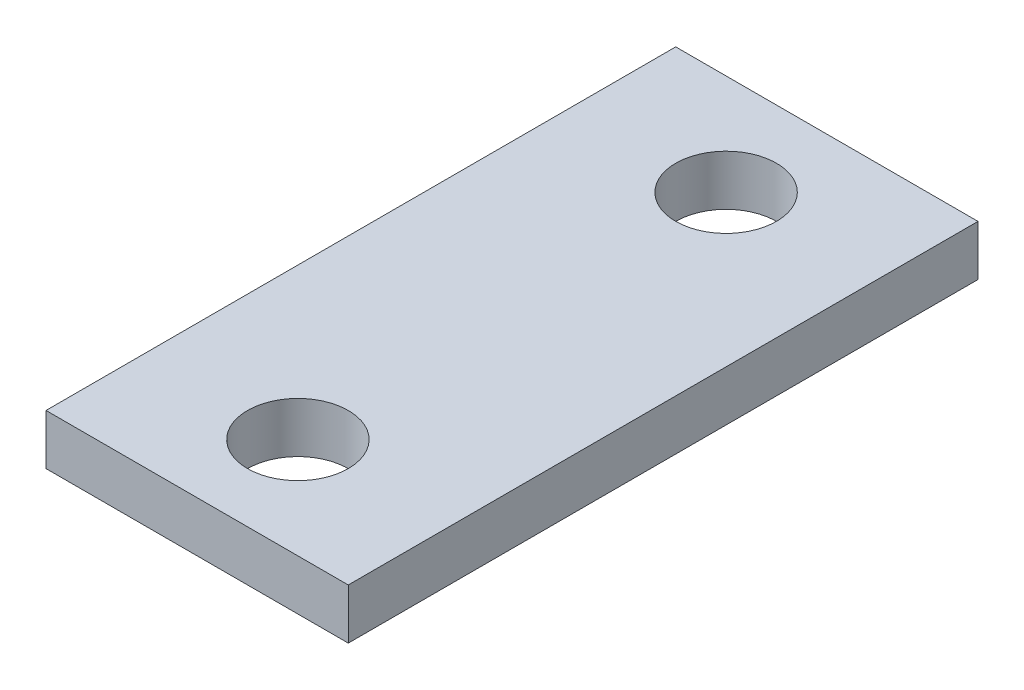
ISO-10303-21;
HEADER;
FILE_DESCRIPTION(('STEP AP214'),'2;1');
FILE_NAME('part.step','',(''),(''),'','','');
FILE_SCHEMA(('AUTOMOTIVE_DESIGN { 1 0 10303 214 1 1 1 1 }'));
ENDSEC;
DATA;
#1=APPLICATION_CONTEXT('core data for automotive mechanical design processes');
#2=APPLICATION_PROTOCOL_DEFINITION('international standard','automotive_design',2000,#1);
#3=PRODUCT_CONTEXT('',#1,'mechanical');
#4=PRODUCT('Part','Part','',(#3));
#5=PRODUCT_RELATED_PRODUCT_CATEGORY('part','',(#4));
#6=PRODUCT_DEFINITION_FORMATION('','',#4);
#7=PRODUCT_DEFINITION_CONTEXT('part definition',#1,'design');
#8=PRODUCT_DEFINITION('design','',#6,#7);
#9=PRODUCT_DEFINITION_SHAPE('','',#8);
#10=(LENGTH_UNIT() NAMED_UNIT(*) SI_UNIT(.MILLI.,.METRE.));
#11=(NAMED_UNIT(*) PLANE_ANGLE_UNIT() SI_UNIT($,.RADIAN.));
#12=(NAMED_UNIT(*) SI_UNIT($,.STERADIAN.) SOLID_ANGLE_UNIT());
#13=UNCERTAINTY_MEASURE_WITH_UNIT(LENGTH_MEASURE(1.E-05),#10,'distance_accuracy_value','');
#14=(GEOMETRIC_REPRESENTATION_CONTEXT(3) GLOBAL_UNCERTAINTY_ASSIGNED_CONTEXT((#13)) GLOBAL_UNIT_ASSIGNED_CONTEXT((#10,
#11,#12)) REPRESENTATION_CONTEXT('',''));
#15=CARTESIAN_POINT('',(0.,0.,0.));
#16=DIRECTION('',(0.,0.,1.));
#17=DIRECTION('',(1.,0.,0.));
#18=AXIS2_PLACEMENT_3D('',#15,#16,#17);
#19=CARTESIAN_POINT('',(0.,2.,0.));
#20=DIRECTION('',(0.,-1.,0.));
#21=DIRECTION('',(0.,0.,-1.));
#22=AXIS2_PLACEMENT_3D('',#19,#20,#21);
#23=PLANE('',#22);
#24=DIRECTION('',(0.,0.,1.));
#25=VECTOR('',#24,1.);
#26=CARTESIAN_POINT('',(0.,2.,0.));
#27=LINE('',#26,#25);
#28=CARTESIAN_POINT('',(0.,2.,-25.));
#29=VERTEX_POINT('',#28);
#30=CARTESIAN_POINT('',(0.,2.,0.));
#31=VERTEX_POINT('',#30);
#32=EDGE_CURVE('E85',#29,#31,#27,.T.);
#33=ORIENTED_EDGE('',*,*,#32,.T.);
#34=DIRECTION('',(1.,0.,0.));
#35=VECTOR('',#34,1.);
#36=CARTESIAN_POINT('',(0.,2.,0.));
#37=LINE('',#36,#35);
#38=CARTESIAN_POINT('',(12.,2.,0.));
#39=VERTEX_POINT('',#38);
#40=EDGE_CURVE('E80',#31,#39,#37,.T.);
#41=ORIENTED_EDGE('',*,*,#40,.T.);
#42=DIRECTION('',(0.,0.,-1.));
#43=VECTOR('',#42,1.);
#44=CARTESIAN_POINT('',(12.,2.,0.));
#45=LINE('',#44,#43);
#46=CARTESIAN_POINT('',(12.,2.,-25.));
#47=VERTEX_POINT('',#46);
#48=EDGE_CURVE('E83',#39,#47,#45,.T.);
#49=ORIENTED_EDGE('',*,*,#48,.T.);
#50=DIRECTION('',(-1.,0.,0.));
#51=VECTOR('',#50,1.);
#52=CARTESIAN_POINT('',(0.,2.,-25.));
#53=LINE('',#52,#51);
#54=EDGE_CURVE('E50',#47,#29,#53,.T.);
#55=ORIENTED_EDGE('',*,*,#54,.T.);
#56=EDGE_LOOP('',(#33,#41,#49,#55));
#57=FACE_BOUND('',#56,.T.);
#58=CARTESIAN_POINT('',(6.,2.,-21.));
#59=DIRECTION('',(0.,1.,0.));
#60=DIRECTION('',(0.,0.,1.));
#61=AXIS2_PLACEMENT_3D('',#58,#59,#60);
#62=CIRCLE('',#61,2.);
#63=CARTESIAN_POINT('',(6.,2.,-19.));
#64=VERTEX_POINT('',#63);
#65=EDGE_CURVE('E100',#64,#64,#62,.T.);
#66=ORIENTED_EDGE('',*,*,#65,.F.);
#67=EDGE_LOOP('',(#66));
#68=FACE_BOUND('',#67,.T.);
#69=CARTESIAN_POINT('',(6.,2.,-4.));
#70=DIRECTION('',(0.,1.,0.));
#71=DIRECTION('',(0.,0.,1.));
#72=AXIS2_PLACEMENT_3D('',#69,#70,#71);
#73=CIRCLE('',#72,2.);
#74=CARTESIAN_POINT('',(6.,2.,-2.));
#75=VERTEX_POINT('',#74);
#76=EDGE_CURVE('E115',#75,#75,#73,.T.);
#77=ORIENTED_EDGE('',*,*,#76,.F.);
#78=EDGE_LOOP('',(#77));
#79=FACE_BOUND('',#78,.T.);
#80=ADVANCED_FACE('F33',(#57,#68,#79),#23,.F.);
#81=CARTESIAN_POINT('',(0.,0.,0.));
#82=DIRECTION('',(0.,-1.,0.));
#83=DIRECTION('',(0.,0.,-1.));
#84=AXIS2_PLACEMENT_3D('',#81,#82,#83);
#85=PLANE('',#84);
#86=CARTESIAN_POINT('',(6.,0.,-21.));
#87=DIRECTION('',(0.,1.,0.));
#88=DIRECTION('',(0.,0.,1.));
#89=AXIS2_PLACEMENT_3D('',#86,#87,#88);
#90=CIRCLE('',#89,2.);
#91=CARTESIAN_POINT('',(6.,0.,-19.));
#92=VERTEX_POINT('',#91);
#93=EDGE_CURVE('E112',#92,#92,#90,.T.);
#94=ORIENTED_EDGE('',*,*,#93,.T.);
#95=EDGE_LOOP('',(#94));
#96=FACE_BOUND('',#95,.T.);
#97=DIRECTION('',(0.,0.,1.));
#98=VECTOR('',#97,1.);
#99=CARTESIAN_POINT('',(0.,0.,0.));
#100=LINE('',#99,#98);
#101=CARTESIAN_POINT('',(0.,0.,-25.));
#102=VERTEX_POINT('',#101);
#103=CARTESIAN_POINT('',(0.,0.,0.));
#104=VERTEX_POINT('',#103);
#105=EDGE_CURVE('E97',#102,#104,#100,.T.);
#106=ORIENTED_EDGE('',*,*,#105,.F.);
#107=DIRECTION('',(-1.,0.,0.));
#108=VECTOR('',#107,1.);
#109=CARTESIAN_POINT('',(0.,0.,-25.));
#110=LINE('',#109,#108);
#111=CARTESIAN_POINT('',(12.,0.,-25.));
#112=VERTEX_POINT('',#111);
#113=EDGE_CURVE('E73',#112,#102,#110,.T.);
#114=ORIENTED_EDGE('',*,*,#113,.F.);
#115=DIRECTION('',(0.,0.,-1.));
#116=VECTOR('',#115,1.);
#117=CARTESIAN_POINT('',(12.,0.,0.));
#118=LINE('',#117,#116);
#119=CARTESIAN_POINT('',(12.,0.,0.));
#120=VERTEX_POINT('',#119);
#121=EDGE_CURVE('E67',#120,#112,#118,.T.);
#122=ORIENTED_EDGE('',*,*,#121,.F.);
#123=DIRECTION('',(1.,0.,0.));
#124=VECTOR('',#123,1.);
#125=CARTESIAN_POINT('',(0.,0.,0.));
#126=LINE('',#125,#124);
#127=EDGE_CURVE('E89',#104,#120,#126,.T.);
#128=ORIENTED_EDGE('',*,*,#127,.F.);
#129=EDGE_LOOP('',(#106,#114,#122,#128));
#130=FACE_BOUND('',#129,.T.);
#131=CARTESIAN_POINT('',(6.,0.,-4.));
#132=DIRECTION('',(0.,1.,0.));
#133=DIRECTION('',(0.,0.,1.));
#134=AXIS2_PLACEMENT_3D('',#131,#132,#133);
#135=CIRCLE('',#134,2.);
#136=CARTESIAN_POINT('',(6.,0.,-2.));
#137=VERTEX_POINT('',#136);
#138=EDGE_CURVE('E118',#137,#137,#135,.T.);
#139=ORIENTED_EDGE('',*,*,#138,.T.);
#140=EDGE_LOOP('',(#139));
#141=FACE_BOUND('',#140,.T.);
#142=ADVANCED_FACE('F108',(#96,#130,#141),#85,.T.);
#143=CARTESIAN_POINT('',(0.,2.,0.));
#144=DIRECTION('',(1.,0.,0.));
#145=DIRECTION('',(0.,0.,-1.));
#146=AXIS2_PLACEMENT_3D('',#143,#144,#145);
#147=PLANE('',#146);
#148=ORIENTED_EDGE('',*,*,#105,.T.);
#149=DIRECTION('',(0.,-1.,0.));
#150=VECTOR('',#149,1.);
#151=CARTESIAN_POINT('',(0.,2.,0.));
#152=LINE('',#151,#150);
#153=EDGE_CURVE('E11',#31,#104,#152,.T.);
#154=ORIENTED_EDGE('',*,*,#153,.F.);
#155=ORIENTED_EDGE('',*,*,#32,.F.);
#156=DIRECTION('',(0.,-1.,0.));
#157=VECTOR('',#156,1.);
#158=CARTESIAN_POINT('',(0.,2.,-25.));
#159=LINE('',#158,#157);
#160=EDGE_CURVE('E93',#29,#102,#159,.T.);
#161=ORIENTED_EDGE('',*,*,#160,.T.);
#162=EDGE_LOOP('',(#148,#154,#155,#161));
#163=FACE_BOUND('',#162,.T.);
#164=ADVANCED_FACE('F35',(#163),#147,.F.);
#165=CARTESIAN_POINT('',(0.,2.,0.));
#166=DIRECTION('',(0.,0.,-1.));
#167=DIRECTION('',(-1.,0.,0.));
#168=AXIS2_PLACEMENT_3D('',#165,#166,#167);
#169=PLANE('',#168);
#170=ORIENTED_EDGE('',*,*,#127,.T.);
#171=DIRECTION('',(0.,-1.,0.));
#172=VECTOR('',#171,1.);
#173=CARTESIAN_POINT('',(12.,2.,0.));
#174=LINE('',#173,#172);
#175=EDGE_CURVE('E42',#39,#120,#174,.T.);
#176=ORIENTED_EDGE('',*,*,#175,.F.);
#177=ORIENTED_EDGE('',*,*,#40,.F.);
#178=ORIENTED_EDGE('',*,*,#153,.T.);
#179=EDGE_LOOP('',(#170,#176,#177,#178));
#180=FACE_BOUND('',#179,.T.);
#181=ADVANCED_FACE('F88',(#180),#169,.F.);
#182=CARTESIAN_POINT('',(12.,2.,0.));
#183=DIRECTION('',(-1.,0.,0.));
#184=DIRECTION('',(0.,0.,1.));
#185=AXIS2_PLACEMENT_3D('',#182,#183,#184);
#186=PLANE('',#185);
#187=ORIENTED_EDGE('',*,*,#121,.T.);
#188=DIRECTION('',(0.,-1.,0.));
#189=VECTOR('',#188,1.);
#190=CARTESIAN_POINT('',(12.,2.,-25.));
#191=LINE('',#190,#189);
#192=EDGE_CURVE('E90',#47,#112,#191,.T.);
#193=ORIENTED_EDGE('',*,*,#192,.F.);
#194=ORIENTED_EDGE('',*,*,#48,.F.);
#195=ORIENTED_EDGE('',*,*,#175,.T.);
#196=EDGE_LOOP('',(#187,#193,#194,#195));
#197=FACE_BOUND('',#196,.T.);
#198=ADVANCED_FACE('F91',(#197),#186,.F.);
#199=CARTESIAN_POINT('',(0.,2.,-25.));
#200=DIRECTION('',(0.,0.,1.));
#201=DIRECTION('',(1.,0.,0.));
#202=AXIS2_PLACEMENT_3D('',#199,#200,#201);
#203=PLANE('',#202);
#204=ORIENTED_EDGE('',*,*,#113,.T.);
#205=ORIENTED_EDGE('',*,*,#160,.F.);
#206=ORIENTED_EDGE('',*,*,#54,.F.);
#207=ORIENTED_EDGE('',*,*,#192,.T.);
#208=EDGE_LOOP('',(#204,#205,#206,#207));
#209=FACE_BOUND('',#208,.T.);
#210=ADVANCED_FACE('F105',(#209),#203,.F.);
#211=CARTESIAN_POINT('',(6.,2.,-21.));
#212=DIRECTION('',(0.,-1.,0.));
#213=DIRECTION('',(0.,0.,-1.));
#214=AXIS2_PLACEMENT_3D('',#211,#212,#213);
#215=CYLINDRICAL_SURFACE('',#214,2.);
#216=ORIENTED_EDGE('',*,*,#65,.T.);
#217=EDGE_LOOP('',(#216));
#218=FACE_BOUND('',#217,.T.);
#219=ORIENTED_EDGE('',*,*,#93,.F.);
#220=EDGE_LOOP('',(#219));
#221=FACE_BOUND('',#220,.T.);
#222=ADVANCED_FACE('F135',(#218,#221),#215,.F.);
#223=CARTESIAN_POINT('',(6.,2.,-4.));
#224=DIRECTION('',(0.,-1.,0.));
#225=DIRECTION('',(0.,0.,-1.));
#226=AXIS2_PLACEMENT_3D('',#223,#224,#225);
#227=CYLINDRICAL_SURFACE('',#226,2.);
#228=ORIENTED_EDGE('',*,*,#76,.T.);
#229=EDGE_LOOP('',(#228));
#230=FACE_BOUND('',#229,.T.);
#231=ORIENTED_EDGE('',*,*,#138,.F.);
#232=EDGE_LOOP('',(#231));
#233=FACE_BOUND('',#232,.T.);
#234=ADVANCED_FACE('F124',(#230,#233),#227,.F.);
#235=CLOSED_SHELL('',(#80,#142,#164,#181,#198,#210,#222,#234));
#236=MANIFOLD_SOLID_BREP('B2',#235);
#237=ADVANCED_BREP_SHAPE_REPRESENTATION('',(#18,#236),#14);
#238=SHAPE_DEFINITION_REPRESENTATION(#9,#237);
ENDSEC;
END-ISO-10303-21;
